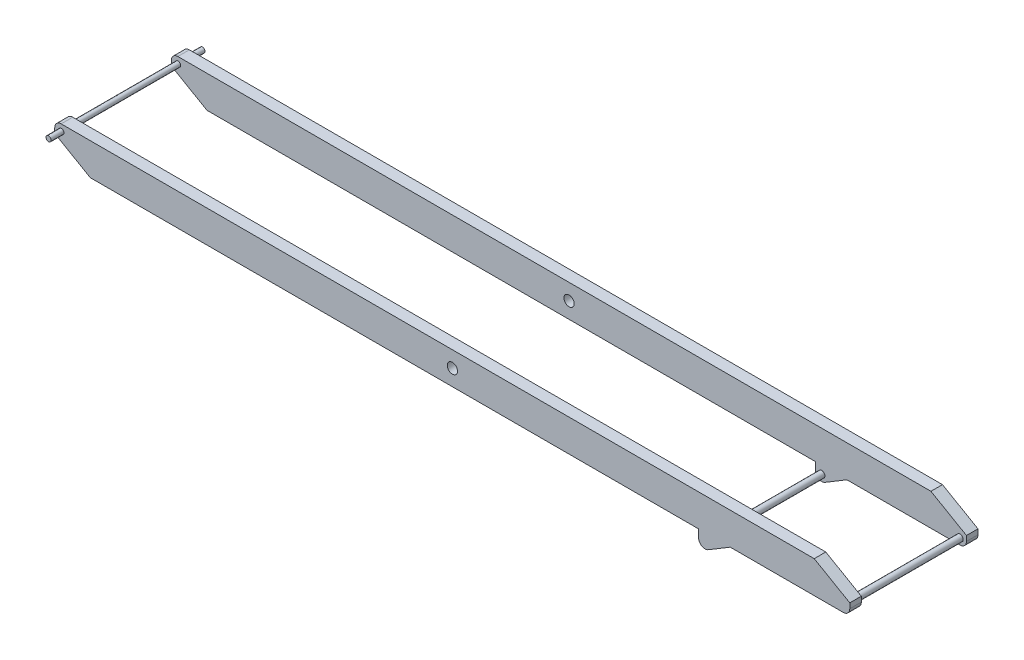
from build123d import *

# Parameters (mm, degrees)
ESQUISSE1_R                  = 25
ESQUISSE1_R_2                = 20
EXTRUSION1_DEPTH             = 500
ESQUISSE2_W                  = 6614.753342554
ESQUISSE2_H                  = 820
ENL_V_MAT_EXTRU_1_DEPTH      = 6176.354240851
ESQUISSE3_R                  = 20
EXTRUSION2_DEPTH             = 600
ESQUISSE4_R                  = 25
EXTRUSION3_DEPTH             = 500
ESQUISSE7_R                  = 25
EXTRUSION4_DEPTH             = 500
EXTRUSION5_DEPTH             = 90
EXTRUSION6_DEPTH             = 90
ENL_V_MAT_EXTRU_3_DEPTH      = 6183.434795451
ENL_V_MAT_EXTRU_3_DEPTH_BACK = 6183.434795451
ESQUISSE5_R                  = 40


with BuildPart() as part:
    # Esquisse1 → Extrusion1 (new, symmetric)
    with BuildSketch(Plane.XY):
        with BuildLine():
            Line((50, 0), (50, 40))
            Line((50, 40), (-227.128129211, 200))
            Line((-227.128129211, 200), (-6100, 200))
            ThreePointArc((-6100, 200), (-6135.355339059, 185.355339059), (-6150, 150))
            Line((-6150, 150), (-6150, 110))
            Line((-6150, 110), (-5872.871870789, -50))
            Line((-5872.871870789, -50), (0, -50))
            ThreePointArc((0, -50), (35.355339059, -35.355339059), (50, 0))
        make_face()
        Circle(ESQUISSE1_R, mode=Mode.SUBTRACT)
        with Locations((-6098.155458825, 150)):
            Circle(ESQUISSE1_R_2, mode=Mode.SUBTRACT)
    extrude(amount=EXTRUSION1_DEPTH, both=True)

    # Esquisse2 → Enl_v. mat.-Extru.1 (cut, through all)
    with BuildSketch(Plane(origin=(0, 200, 0), x_dir=(1, 0, 0), z_dir=(0, 1, 0))):
        with Locations((-3095.379898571, 0)):
            Rectangle(ESQUISSE2_W, ESQUISSE2_H)
    extrude(amount=-ENL_V_MAT_EXTRU_1_DEPTH, mode=Mode.SUBTRACT)


with BuildPart() as enl_v_mat_extru_1_piece_1:
    # of the separate pieces the step leaves, piece 1, a body of its own (enl_v_mat_extru_1_pieces)
    add(part.part.solids().sort_by_distance((0, -50, 500))[0])



with BuildPart() as enl_v_mat_extru_1_piece_2:
    # of the separate pieces the step leaves, piece 2, a body of its own (enl_v_mat_extru_1_pieces)
    add(part.part.solids().sort_by_distance((0, -50, -410))[0])


with BuildPart() as enl_v_mat_extru_1_piece_1_1:
    add(enl_v_mat_extru_1_piece_1.part)

    add(enl_v_mat_extru_1_piece_2.part)  # Extrusion2 merges Enl_v. mat.-Extru.1 piece 2
    # Esquisse3 → Extrusion2 (add, symmetric)
    with BuildSketch(Plane.XY):
        with Locations(Location((-6098.155458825, 150, 0), (0, 0, 180))):
            Circle(ESQUISSE3_R)
    extrude(amount=EXTRUSION2_DEPTH, both=True)

    # Esquisse4 → Extrusion3 (add, symmetric)
    with BuildSketch(Plane.XY):
        with Locations(Location((0, 0, 0), (0, 0, 180))):
            Circle(ESQUISSE4_R)
    extrude(amount=EXTRUSION3_DEPTH, both=True)



with BuildPart() as body_2:
    # Esquisse7 → Extrusion4 (new, symmetric)
    with BuildSketch(Plane.XY):
        with Locations((-1078.917021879, -110)):
            Circle(ESQUISSE7_R)
    extrude(amount=EXTRUSION4_DEPTH, both=True)


with BuildPart() as enl_v_mat_extru_1_piece_1_2:
    add(enl_v_mat_extru_1_piece_1_1.part)

    add(body_2.part)  # Extrusion5 merges body 2
    # Esquisse8 → Extrusion5 (add)
    with BuildSketch(Plane.XY.offset(500)):
        with BuildLine():
            Line((-1128.917021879, -110), (-1128.917021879, -23.102103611))
            Line((-1128.917021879, -23.102103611), (-837.17815558, -23.102103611))
            Line((-837.17815558, -23.102103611), (-1053.168296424, -152.860274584))
            ThreePointArc((-1053.168296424, -152.860274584), (-1103.539813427, -153.516871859), (-1128.917021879, -110))
        make_face()
    extrude(amount=-EXTRUSION5_DEPTH)

    # Esquisse9 → Extrusion6 (add)
    with BuildSketch(Plane(origin=(0, 0, -500), x_dir=(-1, 0, 0), z_dir=(0, 0, -1))):
        with BuildLine():
            Line((0, -50), (881.951293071, -50))
            Line((881.951293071, -50), (1053.168296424, -152.860274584))
            ThreePointArc((1053.168296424, -152.860274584), (1103.539813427, -153.516871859), (1128.917021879, -110))
            Line((1128.917021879, -110), (1128.917021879, -50))
            Line((1128.917021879, -50), (5872.871870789, -50))
            Line((5872.871870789, -50), (6150, 110))
            Line((6150, 110), (6150, 150))
            ThreePointArc((6150, 150), (6135.355339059, 185.355339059), (6100, 200))
            Line((6100, 200), (227.128129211, 200))
            Line((227.128129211, 200), (-50, 40))
            Line((-50, 40), (-50, 0))
            ThreePointArc((-50, 0), (-35.355339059, -35.355339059), (0, -50))
        make_face()
    extrude(amount=-EXTRUSION6_DEPTH)

    # Esquisse5 → Enl_v. mat.-Extru.3 (cut, two sides: drawn at the far end of the back side and taken through both)
    with BuildSketch(Plane.XY.offset(-ENL_V_MAT_EXTRU_3_DEPTH_BACK)):
        with Locations((-3049.077729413, 75)):
            Circle(ESQUISSE5_R)
    extrude(amount=ENL_V_MAT_EXTRU_3_DEPTH + ENL_V_MAT_EXTRU_3_DEPTH_BACK, mode=Mode.SUBTRACT)


solid = enl_v_mat_extru_1_piece_1_2.part
